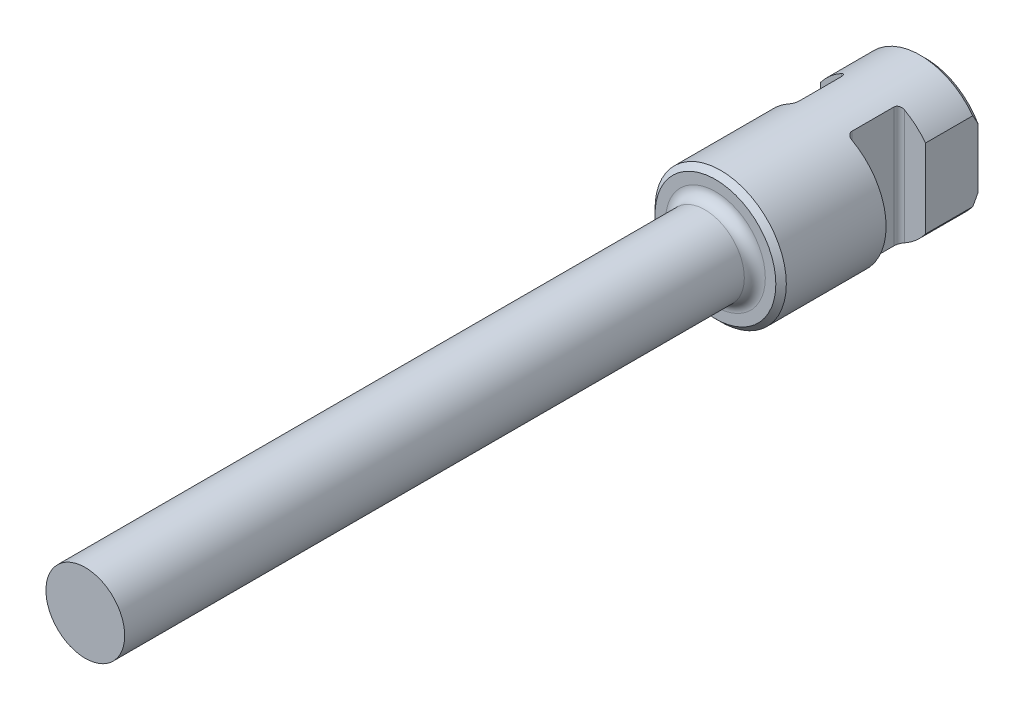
ISO-10303-21;
HEADER;
FILE_DESCRIPTION(('STEP AP214'),'2;1');
FILE_NAME('part.step','',(''),(''),'','','');
FILE_SCHEMA(('AUTOMOTIVE_DESIGN { 1 0 10303 214 1 1 1 1 }'));
ENDSEC;
DATA;
#1=APPLICATION_CONTEXT('core data for automotive mechanical design processes');
#2=APPLICATION_PROTOCOL_DEFINITION('international standard','automotive_design',2000,#1);
#3=PRODUCT_CONTEXT('',#1,'mechanical');
#4=PRODUCT('Part','Part','',(#3));
#5=PRODUCT_RELATED_PRODUCT_CATEGORY('part','',(#4));
#6=PRODUCT_DEFINITION_FORMATION('','',#4);
#7=PRODUCT_DEFINITION_CONTEXT('part definition',#1,'design');
#8=PRODUCT_DEFINITION('design','',#6,#7);
#9=PRODUCT_DEFINITION_SHAPE('','',#8);
#10=(LENGTH_UNIT() NAMED_UNIT(*) SI_UNIT(.MILLI.,.METRE.));
#11=(NAMED_UNIT(*) PLANE_ANGLE_UNIT() SI_UNIT($,.RADIAN.));
#12=(NAMED_UNIT(*) SI_UNIT($,.STERADIAN.) SOLID_ANGLE_UNIT());
#13=UNCERTAINTY_MEASURE_WITH_UNIT(LENGTH_MEASURE(1.E-05),#10,'distance_accuracy_value','');
#14=(GEOMETRIC_REPRESENTATION_CONTEXT(3) GLOBAL_UNCERTAINTY_ASSIGNED_CONTEXT((#13)) GLOBAL_UNIT_ASSIGNED_CONTEXT((#10,
#11,#12)) REPRESENTATION_CONTEXT('',''));
#15=CARTESIAN_POINT('',(0.,0.,0.));
#16=DIRECTION('',(0.,0.,1.));
#17=DIRECTION('',(1.,0.,0.));
#18=AXIS2_PLACEMENT_3D('',#15,#16,#17);
#19=CARTESIAN_POINT('',(0.,0.,8.));
#20=DIRECTION('',(0.,0.,-1.));
#21=DIRECTION('',(-1.,0.,0.));
#22=AXIS2_PLACEMENT_3D('',#19,#20,#21);
#23=CYLINDRICAL_SURFACE('',#22,2.5);
#24=CARTESIAN_POINT('',(0.,0.,7.8));
#25=DIRECTION('',(0.,0.,1.));
#26=DIRECTION('',(1.,0.,0.));
#27=AXIS2_PLACEMENT_3D('',#24,#25,#26);
#28=CIRCLE('',#27,2.5);
#29=CARTESIAN_POINT('',(2.5,0.,7.8));
#30=VERTEX_POINT('',#29);
#31=EDGE_CURVE('E12',#30,#30,#28,.F.);
#32=ORIENTED_EDGE('',*,*,#31,.T.);
#33=EDGE_LOOP('',(#32));
#34=FACE_BOUND('',#33,.T.);
#35=DIRECTION('',(0.,0.,-1.));
#36=VECTOR('',#35,1.);
#37=CARTESIAN_POINT('',(-1.,2.29128784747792,8.));
#38=LINE('',#37,#36);
#39=CARTESIAN_POINT('',(-1.,2.29128784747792,3.8));
#40=VERTEX_POINT('',#39);
#41=CARTESIAN_POINT('',(-1.,2.29128784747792,2.2));
#42=VERTEX_POINT('',#41);
#43=EDGE_CURVE('E335',#40,#42,#38,.T.);
#44=ORIENTED_EDGE('',*,*,#43,.F.);
#45=CARTESIAN_POINT('',(-1.,2.29128784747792,3.8));
#46=CARTESIAN_POINT('',(-0.999987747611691,2.29129110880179,3.81053531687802));
#47=CARTESIAN_POINT('',(-1.00083161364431,2.29092488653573,3.82106342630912));
#48=CARTESIAN_POINT('',(-1.00413639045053,2.2894793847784,3.84178345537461));
#49=CARTESIAN_POINT('',(-1.00659280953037,2.28840208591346,3.85197622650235));
#50=CARTESIAN_POINT('',(-1.01302784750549,2.28556035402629,3.87176364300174));
#51=CARTESIAN_POINT('',(-1.01700618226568,2.28379604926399,3.88135839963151));
#52=CARTESIAN_POINT('',(-1.02632355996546,2.27962411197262,3.89971155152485));
#53=CARTESIAN_POINT('',(-1.03166311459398,2.27721623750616,3.90846963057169));
#54=CARTESIAN_POINT('',(-1.04367990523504,2.27173434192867,3.92519237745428));
#55=CARTESIAN_POINT('',(-1.05039151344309,2.2686429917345,3.93312658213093));
#56=CARTESIAN_POINT('',(-1.06481390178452,2.2619095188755,3.94775069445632));
#57=CARTESIAN_POINT('',(-1.07252480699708,2.25826732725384,3.95444044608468));
#58=CARTESIAN_POINT('',(-1.08934437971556,2.25020492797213,3.96695391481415));
#59=CARTESIAN_POINT('',(-1.0985151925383,2.24574615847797,3.97266905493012));
#60=CARTESIAN_POINT('',(-1.11747304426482,2.23637344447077,3.98249241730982));
#61=CARTESIAN_POINT('',(-1.12726072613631,2.231459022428,3.98659892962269));
#62=CARTESIAN_POINT('',(-1.14748551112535,2.22112782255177,3.99328472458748));
#63=CARTESIAN_POINT('',(-1.15793326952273,2.21570045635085,3.9958149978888));
#64=CARTESIAN_POINT('',(-1.17893825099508,2.20459721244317,3.99917208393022));
#65=CARTESIAN_POINT('',(-1.18949515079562,2.19892196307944,4.00000297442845));
#66=CARTESIAN_POINT('',(-1.2,2.19317121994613,4.));
#67=B_SPLINE_CURVE_WITH_KNOTS('',3,(#45,#46,#47,#48,#49,#50,#51,#52,#53,#54,#55,#56,#57,#58,#59,
#60,#61,#62,#63,#64,#65,#66),.UNSPECIFIED.,.F.,.F.,(4,2,2,2,2,2,2,2,2,2,4),(0.,
0.0315547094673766,0.0630218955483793,0.0944832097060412,0.125956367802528,0.158344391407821,
0.190736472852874,0.225660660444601,0.26062187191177,0.296621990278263,0.33253562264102),.UNSPECIFIED.);
#68=CARTESIAN_POINT('',(-1.2,2.19317121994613,4.));
#69=VERTEX_POINT('',#68);
#70=EDGE_CURVE('E267',#40,#69,#67,.T.);
#71=ORIENTED_EDGE('',*,*,#70,.T.);
#72=CARTESIAN_POINT('',(0.,0.,4.));
#73=DIRECTION('',(0.,0.,-1.));
#74=DIRECTION('',(-1.,0.,0.));
#75=AXIS2_PLACEMENT_3D('',#72,#73,#74);
#76=CIRCLE('',#75,2.5);
#77=CARTESIAN_POINT('',(-1.2,-2.19317121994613,4.));
#78=VERTEX_POINT('',#77);
#79=EDGE_CURVE('E346',#78,#69,#76,.T.);
#80=ORIENTED_EDGE('',*,*,#79,.F.);
#81=CARTESIAN_POINT('',(-1.2,-2.19317121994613,4.));
#82=CARTESIAN_POINT('',(-1.18792326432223,-2.19978428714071,4.00000562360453));
#83=CARTESIAN_POINT('',(-1.1757734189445,-2.20629733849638,3.99890552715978));
#84=CARTESIAN_POINT('',(-1.15164353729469,-2.21898573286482,3.99445397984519));
#85=CARTESIAN_POINT('',(-1.13966450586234,-2.22515943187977,3.99109246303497));
#86=CARTESIAN_POINT('',(-1.11627345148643,-2.23698623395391,3.98206451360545));
#87=CARTESIAN_POINT('',(-1.10486316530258,-2.24263778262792,3.97639145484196));
#88=CARTESIAN_POINT('',(-1.08311903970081,-2.25321962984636,3.96279648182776));
#89=CARTESIAN_POINT('',(-1.07278307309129,-2.25815136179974,3.95487913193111));
#90=CARTESIAN_POINT('',(-1.05451115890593,-2.26673759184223,3.93775188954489));
#91=CARTESIAN_POINT('',(-1.0464433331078,-2.27046680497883,3.92872046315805));
#92=CARTESIAN_POINT('',(-1.03196145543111,-2.27708567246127,3.90913772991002));
#93=CARTESIAN_POINT('',(-1.02554728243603,-2.27997538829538,3.89858653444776));
#94=CARTESIAN_POINT('',(-1.01527851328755,-2.28456515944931,3.87746879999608));
#95=CARTESIAN_POINT('',(-1.01122747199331,-2.2863575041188,3.86701730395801));
#96=CARTESIAN_POINT('',(-1.00492216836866,-2.28913598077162,3.84549448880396));
#97=CARTESIAN_POINT('',(-1.00266422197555,-2.29012376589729,3.83442449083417));
#98=CARTESIAN_POINT('',(-1.00090324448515,-2.29089345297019,3.81938263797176));
#99=CARTESIAN_POINT('',(-1.00056449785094,-2.29104140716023,3.81551220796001));
#100=CARTESIAN_POINT('',(-1.00011317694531,-2.29123846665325,3.80776182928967));
#101=CARTESIAN_POINT('',(-1.00000024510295,-2.29128772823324,3.8038819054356));
#102=CARTESIAN_POINT('',(-0.999999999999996,-2.29128784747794,3.8));
#103=B_SPLINE_CURVE_WITH_KNOTS('',3,(#81,#82,#83,#84,#85,#86,#87,#88,#89,#90,#91,#92,#93,#94,
#95,#96,#97,#98,#99,#100,#101,#102),.UNSPECIFIED.,.F.,.F.,(4,2,2,2,2,2,2,2,2,2,4),(0.,
0.0412874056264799,0.0827598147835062,0.124351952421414,0.165860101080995,0.203663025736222,
0.241463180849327,0.275343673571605,0.309154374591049,0.320812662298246,0.332452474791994),.UNSPECIFIED.);
#104=CARTESIAN_POINT('',(-0.999999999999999,-2.29128784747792,3.8));
#105=VERTEX_POINT('',#104);
#106=EDGE_CURVE('E260',#78,#105,#103,.T.);
#107=ORIENTED_EDGE('',*,*,#106,.T.);
#108=DIRECTION('',(0.,0.,-1.));
#109=VECTOR('',#108,1.);
#110=CARTESIAN_POINT('',(-0.999999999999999,-2.29128784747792,8.));
#111=LINE('',#110,#109);
#112=CARTESIAN_POINT('',(-0.999999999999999,-2.29128784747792,2.2));
#113=VERTEX_POINT('',#112);
#114=EDGE_CURVE('E152',#113,#105,#111,.F.);
#115=ORIENTED_EDGE('',*,*,#114,.F.);
#116=CARTESIAN_POINT('',(-0.999999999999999,-2.29128784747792,2.2));
#117=CARTESIAN_POINT('',(-0.999987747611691,-2.29129110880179,2.18946468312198));
#118=CARTESIAN_POINT('',(-1.00083161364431,-2.29092488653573,2.17893657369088));
#119=CARTESIAN_POINT('',(-1.00413639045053,-2.2894793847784,2.15821654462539));
#120=CARTESIAN_POINT('',(-1.00659280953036,-2.28840208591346,2.14802377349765));
#121=CARTESIAN_POINT('',(-1.01302784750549,-2.28556035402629,2.12823635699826));
#122=CARTESIAN_POINT('',(-1.01700618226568,-2.28379604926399,2.11864160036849));
#123=CARTESIAN_POINT('',(-1.02632355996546,-2.27962411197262,2.10028844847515));
#124=CARTESIAN_POINT('',(-1.03166311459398,-2.27721623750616,2.09153036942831));
#125=CARTESIAN_POINT('',(-1.04367990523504,-2.27173434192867,2.07480762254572));
#126=CARTESIAN_POINT('',(-1.05039151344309,-2.2686429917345,2.06687341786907));
#127=CARTESIAN_POINT('',(-1.06481390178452,-2.2619095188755,2.05224930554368));
#128=CARTESIAN_POINT('',(-1.07252480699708,-2.25826732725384,2.04555955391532));
#129=CARTESIAN_POINT('',(-1.08934437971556,-2.25020492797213,2.03304608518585));
#130=CARTESIAN_POINT('',(-1.0985151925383,-2.24574615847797,2.02733094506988));
#131=CARTESIAN_POINT('',(-1.11747304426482,-2.23637344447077,2.01750758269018));
#132=CARTESIAN_POINT('',(-1.12726072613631,-2.231459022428,2.01340107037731));
#133=CARTESIAN_POINT('',(-1.14748551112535,-2.22112782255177,2.00671527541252));
#134=CARTESIAN_POINT('',(-1.15793326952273,-2.21570045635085,2.0041850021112));
#135=CARTESIAN_POINT('',(-1.17893825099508,-2.20459721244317,2.00082791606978));
#136=CARTESIAN_POINT('',(-1.18949515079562,-2.19892196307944,1.99999702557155));
#137=CARTESIAN_POINT('',(-1.2,-2.19317121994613,2.));
#138=B_SPLINE_CURVE_WITH_KNOTS('',3,(#116,#117,#118,#119,#120,#121,#122,#123,#124,#125,#126,
#127,#128,#129,#130,#131,#132,#133,#134,#135,#136,#137),.UNSPECIFIED.,.F.,.F.,(4,2,2,2,2,2,2,2,
2,2,4),(0.,0.0315547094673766,0.0630218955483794,0.0944832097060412,0.125956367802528,
0.158344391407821,0.190736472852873,0.225660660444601,0.26062187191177,0.296621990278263,
0.33253562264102),.UNSPECIFIED.);
#139=CARTESIAN_POINT('',(-1.2,-2.19317121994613,2.));
#140=VERTEX_POINT('',#139);
#141=EDGE_CURVE('E160',#113,#140,#138,.T.);
#142=ORIENTED_EDGE('',*,*,#141,.T.);
#143=CARTESIAN_POINT('',(0.,0.,2.));
#144=DIRECTION('',(0.,0.,1.));
#145=DIRECTION('',(1.,0.,0.));
#146=AXIS2_PLACEMENT_3D('',#143,#144,#145);
#147=CIRCLE('',#146,2.5);
#148=CARTESIAN_POINT('',(-2.,-1.5,2.));
#149=VERTEX_POINT('',#148);
#150=EDGE_CURVE('E145',#149,#140,#147,.T.);
#151=ORIENTED_EDGE('',*,*,#150,.F.);
#152=DIRECTION('',(0.,0.,-1.));
#153=VECTOR('',#152,1.);
#154=CARTESIAN_POINT('',(-2.,-1.5,8.));
#155=LINE('',#154,#153);
#156=CARTESIAN_POINT('',(-2.,-1.5,0.200000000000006));
#157=VERTEX_POINT('',#156);
#158=EDGE_CURVE('E156',#149,#157,#155,.T.);
#159=ORIENTED_EDGE('',*,*,#158,.T.);
#160=CARTESIAN_POINT('',(0.,0.,0.200000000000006));
#161=DIRECTION('',(0.,0.,1.));
#162=DIRECTION('',(1.,0.,0.));
#163=AXIS2_PLACEMENT_3D('',#160,#161,#162);
#164=CIRCLE('',#163,2.5);
#165=CARTESIAN_POINT('',(2.,-1.5,0.200000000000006));
#166=VERTEX_POINT('',#165);
#167=EDGE_CURVE('E191',#157,#166,#164,.T.);
#168=ORIENTED_EDGE('',*,*,#167,.T.);
#169=DIRECTION('',(0.,0.,-1.));
#170=VECTOR('',#169,1.);
#171=CARTESIAN_POINT('',(2.,-1.5,8.));
#172=LINE('',#171,#170);
#173=CARTESIAN_POINT('',(2.,-1.5,2.));
#174=VERTEX_POINT('',#173);
#175=EDGE_CURVE('E179',#166,#174,#172,.F.);
#176=ORIENTED_EDGE('',*,*,#175,.T.);
#177=CARTESIAN_POINT('',(0.,0.,2.));
#178=DIRECTION('',(0.,0.,1.));
#179=DIRECTION('',(1.,0.,0.));
#180=AXIS2_PLACEMENT_3D('',#177,#178,#179);
#181=CIRCLE('',#180,2.5);
#182=CARTESIAN_POINT('',(1.2,-2.19317121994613,2.));
#183=VERTEX_POINT('',#182);
#184=EDGE_CURVE('E384',#183,#174,#181,.T.);
#185=ORIENTED_EDGE('',*,*,#184,.F.);
#186=CARTESIAN_POINT('',(1.2,-2.19317121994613,2.));
#187=CARTESIAN_POINT('',(1.18792326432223,-2.19978428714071,1.99999437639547));
#188=CARTESIAN_POINT('',(1.1757734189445,-2.20629733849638,2.00109447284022));
#189=CARTESIAN_POINT('',(1.15164353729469,-2.21898573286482,2.00554602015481));
#190=CARTESIAN_POINT('',(1.13966450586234,-2.22515943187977,2.00890753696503));
#191=CARTESIAN_POINT('',(1.11627345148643,-2.23698623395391,2.01793548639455));
#192=CARTESIAN_POINT('',(1.10486316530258,-2.24263778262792,2.02360854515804));
#193=CARTESIAN_POINT('',(1.08311903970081,-2.25321962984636,2.03720351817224));
#194=CARTESIAN_POINT('',(1.07278307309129,-2.25815136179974,2.04512086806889));
#195=CARTESIAN_POINT('',(1.05451115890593,-2.26673759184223,2.06224811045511));
#196=CARTESIAN_POINT('',(1.0464433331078,-2.27046680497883,2.07127953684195));
#197=CARTESIAN_POINT('',(1.03196145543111,-2.27708567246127,2.09086227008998));
#198=CARTESIAN_POINT('',(1.02554728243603,-2.27997538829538,2.10141346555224));
#199=CARTESIAN_POINT('',(1.01527851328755,-2.28456515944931,2.12253120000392));
#200=CARTESIAN_POINT('',(1.01122747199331,-2.2863575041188,2.13298269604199));
#201=CARTESIAN_POINT('',(1.00492216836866,-2.28913598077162,2.15450551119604));
#202=CARTESIAN_POINT('',(1.00266422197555,-2.29012376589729,2.16557550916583));
#203=CARTESIAN_POINT('',(1.00090324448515,-2.29089345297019,2.18061736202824));
#204=CARTESIAN_POINT('',(1.00056449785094,-2.29104140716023,2.18448779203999));
#205=CARTESIAN_POINT('',(1.00011317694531,-2.29123846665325,2.19223817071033));
#206=CARTESIAN_POINT('',(1.00000024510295,-2.29128772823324,2.1961180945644));
#207=CARTESIAN_POINT('',(0.999999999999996,-2.29128784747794,2.2));
#208=B_SPLINE_CURVE_WITH_KNOTS('',3,(#186,#187,#188,#189,#190,#191,#192,#193,#194,#195,#196,
#197,#198,#199,#200,#201,#202,#203,#204,#205,#206,#207),.UNSPECIFIED.,.F.,.F.,(4,2,2,2,2,2,2,2,
2,2,4),(0.,0.0412874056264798,0.0827598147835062,0.124351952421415,0.165860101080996,
0.203663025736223,0.241463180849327,0.275343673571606,0.309154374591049,0.320812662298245,
0.332452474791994),.UNSPECIFIED.);
#209=CARTESIAN_POINT('',(0.999999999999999,-2.29128784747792,2.2));
#210=VERTEX_POINT('',#209);
#211=EDGE_CURVE('E273',#183,#210,#208,.T.);
#212=ORIENTED_EDGE('',*,*,#211,.T.);
#213=DIRECTION('',(0.,0.,-1.));
#214=VECTOR('',#213,1.);
#215=CARTESIAN_POINT('',(0.999999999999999,-2.29128784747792,8.));
#216=LINE('',#215,#214);
#217=CARTESIAN_POINT('',(0.999999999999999,-2.29128784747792,3.8));
#218=VERTEX_POINT('',#217);
#219=EDGE_CURVE('E341',#218,#210,#216,.T.);
#220=ORIENTED_EDGE('',*,*,#219,.F.);
#221=CARTESIAN_POINT('',(0.999999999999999,-2.29128784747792,3.8));
#222=CARTESIAN_POINT('',(0.999987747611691,-2.29129110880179,3.81053531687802));
#223=CARTESIAN_POINT('',(1.00083161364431,-2.29092488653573,3.82106342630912));
#224=CARTESIAN_POINT('',(1.00413639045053,-2.2894793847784,3.84178345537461));
#225=CARTESIAN_POINT('',(1.00659280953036,-2.28840208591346,3.85197622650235));
#226=CARTESIAN_POINT('',(1.01302784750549,-2.28556035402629,3.87176364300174));
#227=CARTESIAN_POINT('',(1.01700618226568,-2.28379604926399,3.88135839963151));
#228=CARTESIAN_POINT('',(1.02632355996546,-2.27962411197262,3.89971155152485));
#229=CARTESIAN_POINT('',(1.03166311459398,-2.27721623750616,3.90846963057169));
#230=CARTESIAN_POINT('',(1.04367990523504,-2.27173434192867,3.92519237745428));
#231=CARTESIAN_POINT('',(1.05039151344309,-2.2686429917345,3.93312658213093));
#232=CARTESIAN_POINT('',(1.06481390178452,-2.2619095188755,3.94775069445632));
#233=CARTESIAN_POINT('',(1.07252480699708,-2.25826732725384,3.95444044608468));
#234=CARTESIAN_POINT('',(1.08934437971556,-2.25020492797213,3.96695391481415));
#235=CARTESIAN_POINT('',(1.0985151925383,-2.24574615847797,3.97266905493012));
#236=CARTESIAN_POINT('',(1.11747304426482,-2.23637344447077,3.98249241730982));
#237=CARTESIAN_POINT('',(1.12726072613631,-2.231459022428,3.98659892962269));
#238=CARTESIAN_POINT('',(1.14748551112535,-2.22112782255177,3.99328472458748));
#239=CARTESIAN_POINT('',(1.15793326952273,-2.21570045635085,3.9958149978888));
#240=CARTESIAN_POINT('',(1.17893825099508,-2.20459721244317,3.99917208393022));
#241=CARTESIAN_POINT('',(1.18949515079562,-2.19892196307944,4.00000297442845));
#242=CARTESIAN_POINT('',(1.2,-2.19317121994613,4.));
#243=B_SPLINE_CURVE_WITH_KNOTS('',3,(#221,#222,#223,#224,#225,#226,#227,#228,#229,#230,#231,
#232,#233,#234,#235,#236,#237,#238,#239,#240,#241,#242),.UNSPECIFIED.,.F.,.F.,(4,2,2,2,2,2,2,2,
2,2,4),(0.,0.0315547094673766,0.0630218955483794,0.0944832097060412,0.125956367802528,
0.158344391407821,0.190736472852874,0.225660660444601,0.26062187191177,0.296621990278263,
0.33253562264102),.UNSPECIFIED.);
#244=CARTESIAN_POINT('',(1.2,-2.19317121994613,4.));
#245=VERTEX_POINT('',#244);
#246=EDGE_CURVE('E52',#218,#245,#243,.T.);
#247=ORIENTED_EDGE('',*,*,#246,.T.);
#248=CARTESIAN_POINT('',(0.,0.,4.));
#249=DIRECTION('',(0.,0.,-1.));
#250=DIRECTION('',(-1.,0.,0.));
#251=AXIS2_PLACEMENT_3D('',#248,#249,#250);
#252=CIRCLE('',#251,2.5);
#253=CARTESIAN_POINT('',(1.2,2.19317121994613,4.));
#254=VERTEX_POINT('',#253);
#255=EDGE_CURVE('E208',#254,#245,#252,.T.);
#256=ORIENTED_EDGE('',*,*,#255,.F.);
#257=CARTESIAN_POINT('',(1.2,2.19317121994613,4.));
#258=CARTESIAN_POINT('',(1.18792326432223,2.19978428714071,4.00000562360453));
#259=CARTESIAN_POINT('',(1.1757734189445,2.20629733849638,3.99890552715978));
#260=CARTESIAN_POINT('',(1.1516435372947,2.21898573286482,3.99445397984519));
#261=CARTESIAN_POINT('',(1.13966450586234,2.22515943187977,3.99109246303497));
#262=CARTESIAN_POINT('',(1.11627345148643,2.23698623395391,3.98206451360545));
#263=CARTESIAN_POINT('',(1.10486316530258,2.24263778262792,3.97639145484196));
#264=CARTESIAN_POINT('',(1.08311903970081,2.25321962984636,3.96279648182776));
#265=CARTESIAN_POINT('',(1.07278307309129,2.25815136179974,3.95487913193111));
#266=CARTESIAN_POINT('',(1.05451115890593,2.26673759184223,3.93775188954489));
#267=CARTESIAN_POINT('',(1.0464433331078,2.27046680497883,3.92872046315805));
#268=CARTESIAN_POINT('',(1.03196145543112,2.27708567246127,3.90913772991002));
#269=CARTESIAN_POINT('',(1.02554728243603,2.27997538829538,3.89858653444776));
#270=CARTESIAN_POINT('',(1.01527851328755,2.28456515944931,3.87746879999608));
#271=CARTESIAN_POINT('',(1.01122747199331,2.2863575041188,3.86701730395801));
#272=CARTESIAN_POINT('',(1.00492216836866,2.28913598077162,3.84549448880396));
#273=CARTESIAN_POINT('',(1.00266422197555,2.29012376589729,3.83442449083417));
#274=CARTESIAN_POINT('',(1.00090324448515,2.29089345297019,3.81938263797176));
#275=CARTESIAN_POINT('',(1.00056449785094,2.29104140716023,3.81551220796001));
#276=CARTESIAN_POINT('',(1.00011317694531,2.29123846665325,3.80776182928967));
#277=CARTESIAN_POINT('',(1.00000024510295,2.29128772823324,3.8038819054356));
#278=CARTESIAN_POINT('',(0.999999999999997,2.29128784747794,3.8));
#279=B_SPLINE_CURVE_WITH_KNOTS('',3,(#257,#258,#259,#260,#261,#262,#263,#264,#265,#266,#267,
#268,#269,#270,#271,#272,#273,#274,#275,#276,#277,#278),.UNSPECIFIED.,.F.,.F.,(4,2,2,2,2,2,2,2,
2,2,4),(0.,0.0412874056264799,0.0827598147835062,0.124351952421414,0.165860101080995,
0.203663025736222,0.241463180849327,0.275343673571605,0.309154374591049,0.320812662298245,
0.332452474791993),.UNSPECIFIED.);
#280=CARTESIAN_POINT('',(1.,2.29128784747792,3.8));
#281=VERTEX_POINT('',#280);
#282=EDGE_CURVE('E60',#254,#281,#279,.T.);
#283=ORIENTED_EDGE('',*,*,#282,.T.);
#284=DIRECTION('',(0.,0.,-1.));
#285=VECTOR('',#284,1.);
#286=CARTESIAN_POINT('',(1.,2.29128784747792,8.));
#287=LINE('',#286,#285);
#288=CARTESIAN_POINT('',(1.,2.29128784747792,2.2));
#289=VERTEX_POINT('',#288);
#290=EDGE_CURVE('E153',#289,#281,#287,.F.);
#291=ORIENTED_EDGE('',*,*,#290,.F.);
#292=CARTESIAN_POINT('',(1.,2.29128784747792,2.2));
#293=CARTESIAN_POINT('',(0.999987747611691,2.29129110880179,2.18946468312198));
#294=CARTESIAN_POINT('',(1.00083161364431,2.29092488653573,2.17893657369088));
#295=CARTESIAN_POINT('',(1.00413639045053,2.2894793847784,2.15821654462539));
#296=CARTESIAN_POINT('',(1.00659280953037,2.28840208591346,2.14802377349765));
#297=CARTESIAN_POINT('',(1.01302784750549,2.28556035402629,2.12823635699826));
#298=CARTESIAN_POINT('',(1.01700618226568,2.28379604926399,2.11864160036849));
#299=CARTESIAN_POINT('',(1.02632355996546,2.27962411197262,2.10028844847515));
#300=CARTESIAN_POINT('',(1.03166311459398,2.27721623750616,2.09153036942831));
#301=CARTESIAN_POINT('',(1.04367990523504,2.27173434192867,2.07480762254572));
#302=CARTESIAN_POINT('',(1.05039151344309,2.2686429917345,2.06687341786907));
#303=CARTESIAN_POINT('',(1.06481390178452,2.2619095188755,2.05224930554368));
#304=CARTESIAN_POINT('',(1.07252480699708,2.25826732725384,2.04555955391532));
#305=CARTESIAN_POINT('',(1.08934437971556,2.25020492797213,2.03304608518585));
#306=CARTESIAN_POINT('',(1.0985151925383,2.24574615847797,2.02733094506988));
#307=CARTESIAN_POINT('',(1.11747304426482,2.23637344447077,2.01750758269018));
#308=CARTESIAN_POINT('',(1.12726072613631,2.231459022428,2.01340107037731));
#309=CARTESIAN_POINT('',(1.14748551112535,2.22112782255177,2.00671527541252));
#310=CARTESIAN_POINT('',(1.15793326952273,2.21570045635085,2.0041850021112));
#311=CARTESIAN_POINT('',(1.17893825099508,2.20459721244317,2.00082791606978));
#312=CARTESIAN_POINT('',(1.18949515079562,2.19892196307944,1.99999702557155));
#313=CARTESIAN_POINT('',(1.2,2.19317121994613,2.));
#314=B_SPLINE_CURVE_WITH_KNOTS('',3,(#292,#293,#294,#295,#296,#297,#298,#299,#300,#301,#302,
#303,#304,#305,#306,#307,#308,#309,#310,#311,#312,#313),.UNSPECIFIED.,.F.,.F.,(4,2,2,2,2,2,2,2,
2,2,4),(0.,0.0315547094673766,0.0630218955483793,0.0944832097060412,0.125956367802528,
0.158344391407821,0.190736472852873,0.225660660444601,0.26062187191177,0.296621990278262,
0.33253562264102),.UNSPECIFIED.);
#315=CARTESIAN_POINT('',(1.2,2.19317121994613,2.));
#316=VERTEX_POINT('',#315);
#317=EDGE_CURVE('E279',#289,#316,#314,.T.);
#318=ORIENTED_EDGE('',*,*,#317,.T.);
#319=CARTESIAN_POINT('',(2.,1.5,2.));
#320=VERTEX_POINT('',#319);
#321=EDGE_CURVE('E171',#320,#316,#181,.T.);
#322=ORIENTED_EDGE('',*,*,#321,.F.);
#323=DIRECTION('',(0.,0.,-1.));
#324=VECTOR('',#323,1.);
#325=CARTESIAN_POINT('',(2.,1.5,8.));
#326=LINE('',#325,#324);
#327=CARTESIAN_POINT('',(2.,1.5,0.200000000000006));
#328=VERTEX_POINT('',#327);
#329=EDGE_CURVE('E177',#320,#328,#326,.T.);
#330=ORIENTED_EDGE('',*,*,#329,.T.);
#331=CARTESIAN_POINT('',(-2.,1.5,0.200000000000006));
#332=VERTEX_POINT('',#331);
#333=EDGE_CURVE('E192',#328,#332,#164,.T.);
#334=ORIENTED_EDGE('',*,*,#333,.T.);
#335=DIRECTION('',(0.,0.,-1.));
#336=VECTOR('',#335,1.);
#337=CARTESIAN_POINT('',(-2.,1.5,8.));
#338=LINE('',#337,#336);
#339=CARTESIAN_POINT('',(-2.,1.5,2.));
#340=VERTEX_POINT('',#339);
#341=EDGE_CURVE('E166',#332,#340,#338,.F.);
#342=ORIENTED_EDGE('',*,*,#341,.T.);
#343=CARTESIAN_POINT('',(-1.2,2.19317121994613,2.));
#344=VERTEX_POINT('',#343);
#345=EDGE_CURVE('E148',#344,#340,#147,.T.);
#346=ORIENTED_EDGE('',*,*,#345,.F.);
#347=CARTESIAN_POINT('',(-1.2,2.19317121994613,2.));
#348=CARTESIAN_POINT('',(-1.18792326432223,2.19978428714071,1.99999437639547));
#349=CARTESIAN_POINT('',(-1.1757734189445,2.20629733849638,2.00109447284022));
#350=CARTESIAN_POINT('',(-1.1516435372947,2.21898573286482,2.00554602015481));
#351=CARTESIAN_POINT('',(-1.13966450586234,2.22515943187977,2.00890753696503));
#352=CARTESIAN_POINT('',(-1.11627345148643,2.23698623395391,2.01793548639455));
#353=CARTESIAN_POINT('',(-1.10486316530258,2.24263778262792,2.02360854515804));
#354=CARTESIAN_POINT('',(-1.08311903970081,2.25321962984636,2.03720351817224));
#355=CARTESIAN_POINT('',(-1.07278307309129,2.25815136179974,2.04512086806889));
#356=CARTESIAN_POINT('',(-1.05451115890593,2.26673759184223,2.06224811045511));
#357=CARTESIAN_POINT('',(-1.0464433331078,2.27046680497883,2.07127953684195));
#358=CARTESIAN_POINT('',(-1.03196145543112,2.27708567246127,2.09086227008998));
#359=CARTESIAN_POINT('',(-1.02554728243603,2.27997538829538,2.10141346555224));
#360=CARTESIAN_POINT('',(-1.01527851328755,2.28456515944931,2.12253120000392));
#361=CARTESIAN_POINT('',(-1.01122747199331,2.2863575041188,2.13298269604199));
#362=CARTESIAN_POINT('',(-1.00492216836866,2.28913598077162,2.15450551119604));
#363=CARTESIAN_POINT('',(-1.00266422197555,2.29012376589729,2.16557550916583));
#364=CARTESIAN_POINT('',(-1.00090324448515,2.29089345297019,2.18061736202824));
#365=CARTESIAN_POINT('',(-1.00056449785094,2.29104140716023,2.18448779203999));
#366=CARTESIAN_POINT('',(-1.00011317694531,2.29123846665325,2.19223817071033));
#367=CARTESIAN_POINT('',(-1.00000024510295,2.29128772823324,2.1961180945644));
#368=CARTESIAN_POINT('',(-0.999999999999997,2.29128784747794,2.2));
#369=B_SPLINE_CURVE_WITH_KNOTS('',3,(#347,#348,#349,#350,#351,#352,#353,#354,#355,#356,#357,
#358,#359,#360,#361,#362,#363,#364,#365,#366,#367,#368),.UNSPECIFIED.,.F.,.F.,(4,2,2,2,2,2,2,2,
2,2,4),(0.,0.0412874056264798,0.0827598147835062,0.124351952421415,0.165860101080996,
0.203663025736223,0.241463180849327,0.275343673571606,0.309154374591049,0.320812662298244,
0.332452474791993),.UNSPECIFIED.);
#370=EDGE_CURVE('E246',#344,#42,#369,.T.);
#371=ORIENTED_EDGE('',*,*,#370,.T.);
#372=EDGE_LOOP('',(#44,#71,#80,#107,#115,#142,#151,#159,#168,#176,#185,#212,#220,#247,#256,#283,
#291,#318,#322,#330,#334,#342,#346,#371));
#373=FACE_BOUND('',#372,.T.);
#374=ADVANCED_FACE('F37',(#34,#373),#23,.T.);
#375=CARTESIAN_POINT('',(-2.,3.,4.));
#376=DIRECTION('',(1.,0.,0.));
#377=DIRECTION('',(0.,1.,0.));
#378=AXIS2_PLACEMENT_3D('',#375,#376,#377);
#379=PLANE('',#378);
#380=DIRECTION('',(0.,-1.,0.));
#381=VECTOR('',#380,1.);
#382=CARTESIAN_POINT('',(-2.,3.,2.));
#383=LINE('',#382,#381);
#384=EDGE_CURVE('E141',#340,#149,#383,.T.);
#385=ORIENTED_EDGE('',*,*,#384,.F.);
#386=ORIENTED_EDGE('',*,*,#341,.F.);
#387=CARTESIAN_POINT('',(-2.,5.12626532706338,3.20259904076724));
#388=CARTESIAN_POINT('',(-2.,4.96967345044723,3.05675952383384));
#389=CARTESIAN_POINT('',(-2.,4.81267849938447,2.91134646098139));
#390=CARTESIAN_POINT('',(-2.,4.49750211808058,2.621741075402));
#391=CARTESIAN_POINT('',(-2.,4.33932042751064,2.47754903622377));
#392=CARTESIAN_POINT('',(-2.,4.02040270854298,2.18986543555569));
#393=CARTESIAN_POINT('',(-2.,3.85965668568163,2.04638492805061));
#394=CARTESIAN_POINT('',(-2.,3.53611238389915,1.76178967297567));
#395=CARTESIAN_POINT('',(-2.,3.37331437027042,1.62067462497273));
#396=CARTESIAN_POINT('',(-2.,3.07767177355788,1.36977431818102));
#397=CARTESIAN_POINT('',(-2.,2.94535341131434,1.25937126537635));
#398=CARTESIAN_POINT('',(-2.,2.67815038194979,1.04162829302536));
#399=CARTESIAN_POINT('',(-2.,2.54326501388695,0.934289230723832));
#400=CARTESIAN_POINT('',(-2.,2.27020390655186,0.724263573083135));
#401=CARTESIAN_POINT('',(-2.,2.1320335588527,0.621570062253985));
#402=CARTESIAN_POINT('',(-2.,1.92111920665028,0.472769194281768));
#403=CARTESIAN_POINT('',(-2.,1.85021970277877,0.424051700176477));
#404=CARTESIAN_POINT('',(-2.,1.7069482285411,0.328839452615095));
#405=CARTESIAN_POINT('',(-2.,1.63457645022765,0.282344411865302));
#406=CARTESIAN_POINT('',(-2.,1.49480297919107,0.19633522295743));
#407=CARTESIAN_POINT('',(-2.,1.42755527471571,0.156572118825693));
#408=CARTESIAN_POINT('',(-2.,1.29139410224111,0.0800264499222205));
#409=CARTESIAN_POINT('',(-2.,1.22248100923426,0.043243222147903));
#410=CARTESIAN_POINT('',(-2.,1.08275125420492,-0.0265240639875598));
#411=CARTESIAN_POINT('',(-2.,1.0119350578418,-0.059509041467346));
#412=CARTESIAN_POINT('',(-2.,0.868268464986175,-0.120630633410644));
#413=CARTESIAN_POINT('',(-2.,0.795418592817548,-0.148768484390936));
#414=CARTESIAN_POINT('',(-2.,0.604554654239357,-0.213501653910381));
#415=CARTESIAN_POINT('',(-2.,0.484868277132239,-0.245526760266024));
#416=CARTESIAN_POINT('',(-2.,0.302820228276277,-0.278088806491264));
#417=CARTESIAN_POINT('',(-2.,0.241804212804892,-0.286362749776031));
#418=CARTESIAN_POINT('',(-2.,0.119260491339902,-0.297374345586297));
#419=CARTESIAN_POINT('',(-2.,0.0577328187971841,-0.30011235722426));
#420=CARTESIAN_POINT('',(-2.,-0.0655143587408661,-0.29988008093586));
#421=CARTESIAN_POINT('',(-2.,-0.127233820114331,-0.296890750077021));
#422=CARTESIAN_POINT('',(-2.,-0.250146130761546,-0.285346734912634));
#423=CARTESIAN_POINT('',(-2.,-0.311338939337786,-0.276791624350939));
#424=CARTESIAN_POINT('',(-2.,-0.432970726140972,-0.254548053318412));
#425=CARTESIAN_POINT('',(-2.,-0.493406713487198,-0.240843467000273));
#426=CARTESIAN_POINT('',(-2.,-0.613065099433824,-0.208942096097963));
#427=CARTESIAN_POINT('',(-2.,-0.672287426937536,-0.19074504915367));
#428=CARTESIAN_POINT('',(-2.,-0.858723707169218,-0.126763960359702));
#429=CARTESIAN_POINT('',(-2.,-0.983478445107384,-0.0738137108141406));
#430=CARTESIAN_POINT('',(-2.,-1.22722075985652,0.0440643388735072));
#431=CARTESIAN_POINT('',(-2.,-1.34619632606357,0.109015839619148));
#432=CARTESIAN_POINT('',(-2.,-1.58098527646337,0.247635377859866));
#433=CARTESIAN_POINT('',(-2.,-1.69673741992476,0.321405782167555));
#434=CARTESIAN_POINT('',(-2.,-1.92447680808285,0.47425844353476));
#435=CARTESIAN_POINT('',(-2.,-2.03646734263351,0.553335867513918));
#436=CARTESIAN_POINT('',(-2.,-2.28372266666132,0.734254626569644));
#437=CARTESIAN_POINT('',(-2.,-2.41826637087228,0.837075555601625));
#438=CARTESIAN_POINT('',(-2.,-2.68437612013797,1.04651607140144));
#439=CARTESIAN_POINT('',(-2.,-2.81594162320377,1.15313634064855));
#440=CARTESIAN_POINT('',(-2.,-3.07700712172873,1.36914173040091));
#441=CARTESIAN_POINT('',(-2.,-3.20650481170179,1.47852962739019));
#442=CARTESIAN_POINT('',(-2.,-3.46384762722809,1.69923365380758));
#443=CARTESIAN_POINT('',(-2.,-3.59169270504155,1.81054983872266));
#444=CARTESIAN_POINT('',(-2.,-3.83801028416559,2.02748731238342));
#445=CARTESIAN_POINT('',(-2.,-3.9565611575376,2.13301979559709));
#446=CARTESIAN_POINT('',(-2.,-4.1927802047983,2.34507277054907));
#447=CARTESIAN_POINT('',(-2.,-4.31044835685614,2.45159328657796));
#448=CARTESIAN_POINT('',(-2.,-4.5448074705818,2.66517344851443));
#449=CARTESIAN_POINT('',(-2.,-4.66150003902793,2.77223133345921));
#450=CARTESIAN_POINT('',(-2.,-4.89429386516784,2.98697699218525));
#451=CARTESIAN_POINT('',(-2.,-5.01039515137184,3.09466473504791));
#452=CARTESIAN_POINT('',(-2.,-5.12626532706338,3.20259904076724));
#453=B_SPLINE_CURVE_WITH_KNOTS('',3,(#387,#388,#389,#390,#391,#392,#393,#394,#395,#396,#397,
#398,#399,#400,#401,#402,#403,#404,#405,#406,#407,#408,#409,#410,#411,#412,#413,#414,#415,#416,
#417,#418,#419,#420,#421,#422,#423,#424,#425,#426,#427,#428,#429,#430,#431,#432,#433,#434,#435,
#436,#437,#438,#439,#440,#441,#442,#443,#444,#445,#446,#447,#448,#449,#450,#451,#452),
.UNSPECIFIED.,.F.,.F.,(4,2,2,2,2,2,2,2,2,2,2,2,2,2,2,2,2,2,2,2,2,2,2,2,2,2,2,2,2,2,2,2,4),(0.,
0.641964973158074,1.28407514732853,1.93046007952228,2.57676228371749,3.09371246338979,
3.61080588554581,4.1271023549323,4.38514356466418,4.6431513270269,4.87746319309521,
5.11172278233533,5.34592556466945,5.58006851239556,5.95011085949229,6.13462062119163,
6.3191184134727,6.50423071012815,6.68935718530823,6.87506829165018,7.0607902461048,
7.46625296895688,7.87252514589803,8.28408051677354,8.69526604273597,9.20316214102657,
9.71114993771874,10.2196693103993,10.7282033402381,11.2043507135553,11.6805098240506,
12.1555935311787,12.6306541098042),.UNSPECIFIED.);
#454=CARTESIAN_POINT('',(-2.,1.13578166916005,0.));
#455=VERTEX_POINT('',#454);
#456=EDGE_CURVE('E348',#332,#455,#453,.T.);
#457=ORIENTED_EDGE('',*,*,#456,.T.);
#458=DIRECTION('',(0.,-1.,0.));
#459=VECTOR('',#458,1.);
#460=CARTESIAN_POINT('',(-2.,3.,0.));
#461=LINE('',#460,#459);
#462=CARTESIAN_POINT('',(-2.,-1.13578166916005,0.));
#463=VERTEX_POINT('',#462);
#464=EDGE_CURVE('E167',#455,#463,#461,.T.);
#465=ORIENTED_EDGE('',*,*,#464,.T.);
#466=EDGE_CURVE('E164',#463,#157,#453,.T.);
#467=ORIENTED_EDGE('',*,*,#466,.T.);
#468=ORIENTED_EDGE('',*,*,#158,.F.);
#469=EDGE_LOOP('',(#385,#386,#457,#465,#467,#468));
#470=FACE_BOUND('',#469,.T.);
#471=ADVANCED_FACE('F162',(#470),#379,.F.);
#472=CARTESIAN_POINT('',(2.,3.,4.));
#473=DIRECTION('',(-1.,0.,0.));
#474=DIRECTION('',(0.,-1.,0.));
#475=AXIS2_PLACEMENT_3D('',#472,#473,#474);
#476=PLANE('',#475);
#477=DIRECTION('',(0.,1.,0.));
#478=VECTOR('',#477,1.);
#479=CARTESIAN_POINT('',(2.,3.,2.));
#480=LINE('',#479,#478);
#481=EDGE_CURVE('E344',#174,#320,#480,.T.);
#482=ORIENTED_EDGE('',*,*,#481,.F.);
#483=ORIENTED_EDGE('',*,*,#175,.F.);
#484=CARTESIAN_POINT('',(2.,-5.12626532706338,3.20259904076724));
#485=CARTESIAN_POINT('',(2.,-4.96967345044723,3.05675952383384));
#486=CARTESIAN_POINT('',(2.,-4.81267849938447,2.91134646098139));
#487=CARTESIAN_POINT('',(2.,-4.49750211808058,2.621741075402));
#488=CARTESIAN_POINT('',(2.,-4.33932042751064,2.47754903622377));
#489=CARTESIAN_POINT('',(2.,-4.02040270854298,2.18986543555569));
#490=CARTESIAN_POINT('',(2.,-3.85965668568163,2.04638492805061));
#491=CARTESIAN_POINT('',(2.,-3.53611238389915,1.76178967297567));
#492=CARTESIAN_POINT('',(2.,-3.37331437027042,1.62067462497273));
#493=CARTESIAN_POINT('',(2.,-3.07767177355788,1.36977431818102));
#494=CARTESIAN_POINT('',(2.,-2.94535341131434,1.25937126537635));
#495=CARTESIAN_POINT('',(2.,-2.67815038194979,1.04162829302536));
#496=CARTESIAN_POINT('',(2.,-2.54326501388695,0.93428923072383));
#497=CARTESIAN_POINT('',(2.,-2.27020390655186,0.724263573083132));
#498=CARTESIAN_POINT('',(2.,-2.13203355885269,0.621570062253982));
#499=CARTESIAN_POINT('',(2.,-1.92111920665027,0.472769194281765));
#500=CARTESIAN_POINT('',(2.,-1.85021970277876,0.424051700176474));
#501=CARTESIAN_POINT('',(2.,-1.7069482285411,0.328839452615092));
#502=CARTESIAN_POINT('',(2.,-1.63457645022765,0.282344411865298));
#503=CARTESIAN_POINT('',(2.,-1.49480297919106,0.196335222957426));
#504=CARTESIAN_POINT('',(2.,-1.42755527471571,0.15657211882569));
#505=CARTESIAN_POINT('',(2.,-1.2913941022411,0.0800264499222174));
#506=CARTESIAN_POINT('',(2.,-1.22248100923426,0.0432432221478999));
#507=CARTESIAN_POINT('',(2.,-1.08275125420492,-0.0265240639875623));
#508=CARTESIAN_POINT('',(2.,-1.0119350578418,-0.059509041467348));
#509=CARTESIAN_POINT('',(2.,-0.868268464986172,-0.120630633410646));
#510=CARTESIAN_POINT('',(2.,-0.795418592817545,-0.148768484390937));
#511=CARTESIAN_POINT('',(2.,-0.604554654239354,-0.213501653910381));
#512=CARTESIAN_POINT('',(2.,-0.484868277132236,-0.245526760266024));
#513=CARTESIAN_POINT('',(2.,-0.302820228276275,-0.278088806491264));
#514=CARTESIAN_POINT('',(2.,-0.24180421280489,-0.286362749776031));
#515=CARTESIAN_POINT('',(2.,-0.119260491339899,-0.297374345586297));
#516=CARTESIAN_POINT('',(2.,-0.0577328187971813,-0.30011235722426));
#517=CARTESIAN_POINT('',(2.,0.0655143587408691,-0.29988008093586));
#518=CARTESIAN_POINT('',(2.,0.127233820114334,-0.29689075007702));
#519=CARTESIAN_POINT('',(2.,0.250146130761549,-0.285346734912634));
#520=CARTESIAN_POINT('',(2.,0.311338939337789,-0.276791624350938));
#521=CARTESIAN_POINT('',(2.,0.432970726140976,-0.254548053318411));
#522=CARTESIAN_POINT('',(2.,0.493406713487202,-0.240843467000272));
#523=CARTESIAN_POINT('',(2.,0.613065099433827,-0.208942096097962));
#524=CARTESIAN_POINT('',(2.,0.672287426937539,-0.190745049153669));
#525=CARTESIAN_POINT('',(2.,0.858723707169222,-0.1267639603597));
#526=CARTESIAN_POINT('',(2.,0.983478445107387,-0.0738137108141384));
#527=CARTESIAN_POINT('',(2.,1.22722075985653,0.0440643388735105));
#528=CARTESIAN_POINT('',(2.,1.34619632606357,0.109015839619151));
#529=CARTESIAN_POINT('',(2.,1.58098527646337,0.24763537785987));
#530=CARTESIAN_POINT('',(2.,1.69673741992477,0.32140578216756));
#531=CARTESIAN_POINT('',(2.,1.92447680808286,0.474258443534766));
#532=CARTESIAN_POINT('',(2.,2.03646734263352,0.553335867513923));
#533=CARTESIAN_POINT('',(2.,2.28372266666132,0.73425462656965));
#534=CARTESIAN_POINT('',(2.,2.41826637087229,0.837075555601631));
#535=CARTESIAN_POINT('',(2.,2.68437612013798,1.04651607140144));
#536=CARTESIAN_POINT('',(2.,2.81594162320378,1.15313634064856));
#537=CARTESIAN_POINT('',(2.,3.07700712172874,1.36914173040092));
#538=CARTESIAN_POINT('',(2.,3.20650481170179,1.47852962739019));
#539=CARTESIAN_POINT('',(2.,3.46384762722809,1.69923365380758));
#540=CARTESIAN_POINT('',(2.,3.59169270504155,1.81054983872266));
#541=CARTESIAN_POINT('',(2.,3.8380102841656,2.02748731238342));
#542=CARTESIAN_POINT('',(2.,3.9565611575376,2.13301979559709));
#543=CARTESIAN_POINT('',(2.,4.1927802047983,2.34507277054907));
#544=CARTESIAN_POINT('',(2.,4.31044835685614,2.45159328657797));
#545=CARTESIAN_POINT('',(2.,4.5448074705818,2.66517344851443));
#546=CARTESIAN_POINT('',(2.,4.66150003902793,2.77223133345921));
#547=CARTESIAN_POINT('',(2.,4.89429386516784,2.98697699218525));
#548=CARTESIAN_POINT('',(2.,5.01039515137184,3.09466473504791));
#549=CARTESIAN_POINT('',(2.,5.12626532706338,3.20259904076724));
#550=B_SPLINE_CURVE_WITH_KNOTS('',3,(#484,#485,#486,#487,#488,#489,#490,#491,#492,#493,#494,
#495,#496,#497,#498,#499,#500,#501,#502,#503,#504,#505,#506,#507,#508,#509,#510,#511,#512,#513,
#514,#515,#516,#517,#518,#519,#520,#521,#522,#523,#524,#525,#526,#527,#528,#529,#530,#531,#532,
#533,#534,#535,#536,#537,#538,#539,#540,#541,#542,#543,#544,#545,#546,#547,#548,#549),
.UNSPECIFIED.,.F.,.F.,(4,2,2,2,2,2,2,2,2,2,2,2,2,2,2,2,2,2,2,2,2,2,2,2,2,2,2,2,2,2,2,2,4),(0.,
0.641964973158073,1.28407514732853,1.93046007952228,2.57676228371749,3.09371246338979,
3.61080588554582,4.12710235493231,4.38514356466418,4.6431513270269,4.87746319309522,
5.11172278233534,5.34592556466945,5.58006851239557,5.9501108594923,6.13462062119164,
6.31911841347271,6.50423071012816,6.68935718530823,6.87506829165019,7.06079024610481,
7.46625296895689,7.87252514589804,8.28408051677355,8.69526604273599,9.20316214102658,
9.71114993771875,10.2196693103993,10.7282033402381,11.2043507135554,11.6805098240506,
12.1555935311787,12.6306541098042),.UNSPECIFIED.);
#551=CARTESIAN_POINT('',(2.,-1.13578166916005,0.));
#552=VERTEX_POINT('',#551);
#553=EDGE_CURVE('E207',#166,#552,#550,.T.);
#554=ORIENTED_EDGE('',*,*,#553,.T.);
#555=DIRECTION('',(0.,1.,0.));
#556=VECTOR('',#555,1.);
#557=CARTESIAN_POINT('',(2.,3.,0.));
#558=LINE('',#557,#556);
#559=CARTESIAN_POINT('',(2.,1.13578166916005,0.));
#560=VERTEX_POINT('',#559);
#561=EDGE_CURVE('E169',#552,#560,#558,.T.);
#562=ORIENTED_EDGE('',*,*,#561,.T.);
#563=EDGE_CURVE('E199',#560,#328,#550,.T.);
#564=ORIENTED_EDGE('',*,*,#563,.T.);
#565=ORIENTED_EDGE('',*,*,#329,.F.);
#566=EDGE_LOOP('',(#482,#483,#554,#562,#564,#565));
#567=FACE_BOUND('',#566,.T.);
#568=ADVANCED_FACE('F214',(#567),#476,.F.);
#569=CARTESIAN_POINT('',(0.,0.,0.200000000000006));
#570=DIRECTION('',(0.,0.,1.));
#571=DIRECTION('',(1.,0.,0.));
#572=AXIS2_PLACEMENT_3D('',#569,#570,#571);
#573=CONICAL_SURFACE('',#572,2.5,0.785398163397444);
#574=ORIENTED_EDGE('',*,*,#456,.F.);
#575=ORIENTED_EDGE('',*,*,#333,.F.);
#576=ORIENTED_EDGE('',*,*,#563,.F.);
#577=CARTESIAN_POINT('',(0.,0.,0.));
#578=DIRECTION('',(0.,0.,1.));
#579=DIRECTION('',(1.,0.,0.));
#580=AXIS2_PLACEMENT_3D('',#577,#578,#579);
#581=CIRCLE('',#580,2.3);
#582=EDGE_CURVE('E195',#455,#560,#581,.F.);
#583=ORIENTED_EDGE('',*,*,#582,.F.);
#584=EDGE_LOOP('',(#574,#575,#576,#583));
#585=FACE_BOUND('',#584,.T.);
#586=ADVANCED_FACE('F219',(#585),#573,.T.);
#587=CARTESIAN_POINT('',(0.,0.,8.));
#588=DIRECTION('',(0.,0.,1.));
#589=DIRECTION('',(1.,0.,0.));
#590=AXIS2_PLACEMENT_3D('',#587,#588,#589);
#591=PLANE('',#590);
#592=CARTESIAN_POINT('',(0.,0.,8.));
#593=DIRECTION('',(0.,0.,1.));
#594=DIRECTION('',(1.,0.,0.));
#595=AXIS2_PLACEMENT_3D('',#592,#593,#594);
#596=CIRCLE('',#595,2.3);
#597=CARTESIAN_POINT('',(2.3,0.,8.));
#598=VERTEX_POINT('',#597);
#599=EDGE_CURVE('E45',#598,#598,#596,.T.);
#600=ORIENTED_EDGE('',*,*,#599,.T.);
#601=EDGE_LOOP('',(#600));
#602=FACE_BOUND('',#601,.T.);
#603=CARTESIAN_POINT('',(0.,0.,8.));
#604=DIRECTION('',(0.,0.,1.));
#605=DIRECTION('',(1.,0.,0.));
#606=AXIS2_PLACEMENT_3D('',#603,#604,#605);
#607=CIRCLE('',#606,1.9);
#608=CARTESIAN_POINT('',(1.9,0.,8.));
#609=VERTEX_POINT('',#608);
#610=EDGE_CURVE('E188',#609,#609,#607,.F.);
#611=ORIENTED_EDGE('',*,*,#610,.T.);
#612=EDGE_LOOP('',(#611));
#613=FACE_BOUND('',#612,.T.);
#614=ADVANCED_FACE('F233',(#602,#613),#591,.T.);
#615=CARTESIAN_POINT('',(0.,0.,0.));
#616=DIRECTION('',(0.,0.,1.));
#617=DIRECTION('',(1.,0.,0.));
#618=AXIS2_PLACEMENT_3D('',#615,#616,#617);
#619=PLANE('',#618);
#620=EDGE_CURVE('E196',#552,#463,#581,.F.);
#621=ORIENTED_EDGE('',*,*,#620,.T.);
#622=ORIENTED_EDGE('',*,*,#464,.F.);
#623=ORIENTED_EDGE('',*,*,#582,.T.);
#624=ORIENTED_EDGE('',*,*,#561,.F.);
#625=EDGE_LOOP('',(#621,#622,#623,#624));
#626=FACE_BOUND('',#625,.T.);
#627=ADVANCED_FACE('F231',(#626),#619,.F.);
#628=CARTESIAN_POINT('',(0.,0.,32.));
#629=DIRECTION('',(0.,0.,-1.));
#630=DIRECTION('',(-1.,0.,0.));
#631=AXIS2_PLACEMENT_3D('',#628,#629,#630);
#632=CYLINDRICAL_SURFACE('',#631,1.5);
#633=CARTESIAN_POINT('',(0.,0.,8.4));
#634=DIRECTION('',(0.,0.,1.));
#635=DIRECTION('',(1.,0.,0.));
#636=AXIS2_PLACEMENT_3D('',#633,#634,#635);
#637=CIRCLE('',#636,1.5);
#638=CARTESIAN_POINT('',(1.5,0.,8.4));
#639=VERTEX_POINT('',#638);
#640=EDGE_CURVE('E185',#639,#639,#637,.T.);
#641=ORIENTED_EDGE('',*,*,#640,.T.);
#642=EDGE_LOOP('',(#641));
#643=FACE_BOUND('',#642,.T.);
#644=CARTESIAN_POINT('',(0.,0.,32.));
#645=DIRECTION('',(0.,0.,1.));
#646=DIRECTION('',(1.,0.,0.));
#647=AXIS2_PLACEMENT_3D('',#644,#645,#646);
#648=CIRCLE('',#647,1.5);
#649=CARTESIAN_POINT('',(1.5,0.,32.));
#650=VERTEX_POINT('',#649);
#651=EDGE_CURVE('E182',#650,#650,#648,.T.);
#652=ORIENTED_EDGE('',*,*,#651,.F.);
#653=EDGE_LOOP('',(#652));
#654=FACE_BOUND('',#653,.T.);
#655=ADVANCED_FACE('F227',(#643,#654),#632,.T.);
#656=CARTESIAN_POINT('',(0.,0.,32.));
#657=DIRECTION('',(0.,0.,1.));
#658=DIRECTION('',(1.,0.,0.));
#659=AXIS2_PLACEMENT_3D('',#656,#657,#658);
#660=PLANE('',#659);
#661=ORIENTED_EDGE('',*,*,#651,.T.);
#662=EDGE_LOOP('',(#661));
#663=FACE_BOUND('',#662,.T.);
#664=ADVANCED_FACE('F223',(#663),#660,.T.);
#665=CARTESIAN_POINT('',(0.,0.,8.4));
#666=DIRECTION('',(0.,0.,1.));
#667=DIRECTION('',(1.,0.,0.));
#668=AXIS2_PLACEMENT_3D('',#665,#666,#667);
#669=TOROIDAL_SURFACE('',#668,1.9,0.4);
#670=ORIENTED_EDGE('',*,*,#610,.F.);
#671=EDGE_LOOP('',(#670));
#672=FACE_BOUND('',#671,.T.);
#673=ORIENTED_EDGE('',*,*,#640,.F.);
#674=EDGE_LOOP('',(#673));
#675=FACE_BOUND('',#674,.T.);
#676=ADVANCED_FACE('F226',(#672,#675),#669,.F.);
#677=ORIENTED_EDGE('',*,*,#466,.F.);
#678=ORIENTED_EDGE('',*,*,#620,.F.);
#679=ORIENTED_EDGE('',*,*,#553,.F.);
#680=ORIENTED_EDGE('',*,*,#167,.F.);
#681=EDGE_LOOP('',(#677,#678,#679,#680));
#682=FACE_BOUND('',#681,.T.);
#683=ADVANCED_FACE('F210',(#682),#573,.T.);
#684=CARTESIAN_POINT('',(0.,0.,4.));
#685=DIRECTION('',(0.,0.,-1.));
#686=DIRECTION('',(-1.,0.,0.));
#687=AXIS2_PLACEMENT_3D('',#684,#685,#686);
#688=PLANE('',#687);
#689=ORIENTED_EDGE('',*,*,#255,.T.);
#690=DIRECTION('',(0.,1.,0.));
#691=VECTOR('',#690,1.);
#692=CARTESIAN_POINT('',(1.2,2.29128784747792,4.));
#693=LINE('',#692,#691);
#694=EDGE_CURVE('E317',#245,#254,#693,.T.);
#695=ORIENTED_EDGE('',*,*,#694,.T.);
#696=EDGE_LOOP('',(#689,#695));
#697=FACE_BOUND('',#696,.T.);
#698=ADVANCED_FACE('F221',(#697),#688,.T.);
#699=CARTESIAN_POINT('',(0.,0.,4.));
#700=DIRECTION('',(0.,0.,-1.));
#701=DIRECTION('',(-1.,0.,0.));
#702=AXIS2_PLACEMENT_3D('',#699,#700,#701);
#703=PLANE('',#702);
#704=ORIENTED_EDGE('',*,*,#79,.T.);
#705=DIRECTION('',(0.,-1.,0.));
#706=VECTOR('',#705,1.);
#707=CARTESIAN_POINT('',(-1.2,-2.29128784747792,4.));
#708=LINE('',#707,#706);
#709=EDGE_CURVE('E328',#69,#78,#708,.T.);
#710=ORIENTED_EDGE('',*,*,#709,.T.);
#711=EDGE_LOOP('',(#704,#710));
#712=FACE_BOUND('',#711,.T.);
#713=ADVANCED_FACE('F355',(#712),#703,.T.);
#714=CARTESIAN_POINT('',(1.,3.,-6.32455532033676));
#715=DIRECTION('',(1.,0.,0.));
#716=DIRECTION('',(0.,1.,0.));
#717=AXIS2_PLACEMENT_3D('',#714,#715,#716);
#718=PLANE('',#717);
#719=ORIENTED_EDGE('',*,*,#219,.T.);
#720=DIRECTION('',(0.,-1.,0.));
#721=VECTOR('',#720,1.);
#722=CARTESIAN_POINT('',(1.,2.29128784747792,2.2));
#723=LINE('',#722,#721);
#724=EDGE_CURVE('E319',#210,#289,#723,.F.);
#725=ORIENTED_EDGE('',*,*,#724,.T.);
#726=ORIENTED_EDGE('',*,*,#290,.T.);
#727=DIRECTION('',(0.,1.,0.));
#728=VECTOR('',#727,1.);
#729=CARTESIAN_POINT('',(0.999999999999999,-2.29128784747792,3.8));
#730=LINE('',#729,#728);
#731=EDGE_CURVE('E321',#281,#218,#730,.F.);
#732=ORIENTED_EDGE('',*,*,#731,.T.);
#733=EDGE_LOOP('',(#719,#725,#726,#732));
#734=FACE_BOUND('',#733,.T.);
#735=ADVANCED_FACE('F358',(#734),#718,.T.);
#736=CARTESIAN_POINT('',(0.,0.,2.));
#737=DIRECTION('',(0.,0.,1.));
#738=DIRECTION('',(1.,0.,0.));
#739=AXIS2_PLACEMENT_3D('',#736,#737,#738);
#740=PLANE('',#739);
#741=ORIENTED_EDGE('',*,*,#321,.T.);
#742=DIRECTION('',(0.,-1.,0.));
#743=VECTOR('',#742,1.);
#744=CARTESIAN_POINT('',(1.2,-2.29128784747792,2.));
#745=LINE('',#744,#743);
#746=EDGE_CURVE('E325',#316,#183,#745,.T.);
#747=ORIENTED_EDGE('',*,*,#746,.T.);
#748=ORIENTED_EDGE('',*,*,#184,.T.);
#749=ORIENTED_EDGE('',*,*,#481,.T.);
#750=EDGE_LOOP('',(#741,#747,#748,#749));
#751=FACE_BOUND('',#750,.T.);
#752=ADVANCED_FACE('F362',(#751),#740,.T.);
#753=CARTESIAN_POINT('',(-1.,3.,-6.32455532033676));
#754=DIRECTION('',(-1.,0.,0.));
#755=DIRECTION('',(0.,-1.,0.));
#756=AXIS2_PLACEMENT_3D('',#753,#754,#755);
#757=PLANE('',#756);
#758=ORIENTED_EDGE('',*,*,#43,.T.);
#759=DIRECTION('',(0.,1.,0.));
#760=VECTOR('',#759,1.);
#761=CARTESIAN_POINT('',(-0.999999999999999,-2.29128784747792,2.2));
#762=LINE('',#761,#760);
#763=EDGE_CURVE('E315',#42,#113,#762,.F.);
#764=ORIENTED_EDGE('',*,*,#763,.T.);
#765=ORIENTED_EDGE('',*,*,#114,.T.);
#766=DIRECTION('',(0.,-1.,0.));
#767=VECTOR('',#766,1.);
#768=CARTESIAN_POINT('',(-1.,2.29128784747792,3.8));
#769=LINE('',#768,#767);
#770=EDGE_CURVE('E332',#105,#40,#769,.F.);
#771=ORIENTED_EDGE('',*,*,#770,.T.);
#772=EDGE_LOOP('',(#758,#764,#765,#771));
#773=FACE_BOUND('',#772,.T.);
#774=ADVANCED_FACE('F312',(#773),#757,.T.);
#775=CARTESIAN_POINT('',(0.,0.,2.));
#776=DIRECTION('',(0.,0.,1.));
#777=DIRECTION('',(1.,0.,0.));
#778=AXIS2_PLACEMENT_3D('',#775,#776,#777);
#779=PLANE('',#778);
#780=ORIENTED_EDGE('',*,*,#150,.T.);
#781=DIRECTION('',(0.,1.,0.));
#782=VECTOR('',#781,1.);
#783=CARTESIAN_POINT('',(-1.2,2.29128784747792,2.));
#784=LINE('',#783,#782);
#785=EDGE_CURVE('E316',#140,#344,#784,.T.);
#786=ORIENTED_EDGE('',*,*,#785,.T.);
#787=ORIENTED_EDGE('',*,*,#345,.T.);
#788=ORIENTED_EDGE('',*,*,#384,.T.);
#789=EDGE_LOOP('',(#780,#786,#787,#788));
#790=FACE_BOUND('',#789,.T.);
#791=ADVANCED_FACE('F143',(#790),#779,.T.);
#792=CARTESIAN_POINT('',(-1.2,0.,2.2));
#793=DIRECTION('',(0.,-1.,0.));
#794=DIRECTION('',(1.,0.,0.));
#795=AXIS2_PLACEMENT_3D('',#792,#793,#794);
#796=CYLINDRICAL_SURFACE('',#795,0.2);
#797=ORIENTED_EDGE('',*,*,#141,.F.);
#798=ORIENTED_EDGE('',*,*,#763,.F.);
#799=ORIENTED_EDGE('',*,*,#370,.F.);
#800=ORIENTED_EDGE('',*,*,#785,.F.);
#801=EDGE_LOOP('',(#797,#798,#799,#800));
#802=FACE_BOUND('',#801,.T.);
#803=ADVANCED_FACE('F302',(#802),#796,.F.);
#804=CARTESIAN_POINT('',(-1.2,0.,3.8));
#805=DIRECTION('',(0.,1.,0.));
#806=DIRECTION('',(-1.,0.,0.));
#807=AXIS2_PLACEMENT_3D('',#804,#805,#806);
#808=CYLINDRICAL_SURFACE('',#807,0.2);
#809=ORIENTED_EDGE('',*,*,#70,.F.);
#810=ORIENTED_EDGE('',*,*,#770,.F.);
#811=ORIENTED_EDGE('',*,*,#106,.F.);
#812=ORIENTED_EDGE('',*,*,#709,.F.);
#813=EDGE_LOOP('',(#809,#810,#811,#812));
#814=FACE_BOUND('',#813,.T.);
#815=ADVANCED_FACE('F297',(#814),#808,.F.);
#816=CARTESIAN_POINT('',(1.2,0.,2.2));
#817=DIRECTION('',(0.,1.,0.));
#818=DIRECTION('',(-1.,0.,0.));
#819=AXIS2_PLACEMENT_3D('',#816,#817,#818);
#820=CYLINDRICAL_SURFACE('',#819,0.2);
#821=ORIENTED_EDGE('',*,*,#317,.F.);
#822=ORIENTED_EDGE('',*,*,#724,.F.);
#823=ORIENTED_EDGE('',*,*,#211,.F.);
#824=ORIENTED_EDGE('',*,*,#746,.F.);
#825=EDGE_LOOP('',(#821,#822,#823,#824));
#826=FACE_BOUND('',#825,.T.);
#827=ADVANCED_FACE('F293',(#826),#820,.F.);
#828=CARTESIAN_POINT('',(1.2,0.,3.8));
#829=DIRECTION('',(0.,-1.,0.));
#830=DIRECTION('',(1.,0.,0.));
#831=AXIS2_PLACEMENT_3D('',#828,#829,#830);
#832=CYLINDRICAL_SURFACE('',#831,0.2);
#833=ORIENTED_EDGE('',*,*,#246,.F.);
#834=ORIENTED_EDGE('',*,*,#731,.F.);
#835=ORIENTED_EDGE('',*,*,#282,.F.);
#836=ORIENTED_EDGE('',*,*,#694,.F.);
#837=EDGE_LOOP('',(#833,#834,#835,#836));
#838=FACE_BOUND('',#837,.T.);
#839=ADVANCED_FACE('F290',(#838),#832,.F.);
#840=CARTESIAN_POINT('',(0.,0.,8.));
#841=DIRECTION('',(0.,0.,-1.));
#842=DIRECTION('',(-1.,0.,0.));
#843=AXIS2_PLACEMENT_3D('',#840,#841,#842);
#844=CONICAL_SURFACE('',#843,2.3,0.785398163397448);
#845=ORIENTED_EDGE('',*,*,#31,.F.);
#846=EDGE_LOOP('',(#845));
#847=FACE_BOUND('',#846,.T.);
#848=ORIENTED_EDGE('',*,*,#599,.F.);
#849=EDGE_LOOP('',(#848));
#850=FACE_BOUND('',#849,.T.);
#851=ADVANCED_FACE('F39',(#847,#850),#844,.T.);
#852=CLOSED_SHELL('',(#374,#471,#568,#586,#614,#627,#655,#664,#676,#683,#698,#713,#735,#752,
#774,#791,#803,#815,#827,#839,#851));
#853=MANIFOLD_SOLID_BREP('B2',#852);
#854=ADVANCED_BREP_SHAPE_REPRESENTATION('',(#18,#853),#14);
#855=SHAPE_DEFINITION_REPRESENTATION(#9,#854);
ENDSEC;
END-ISO-10303-21;
